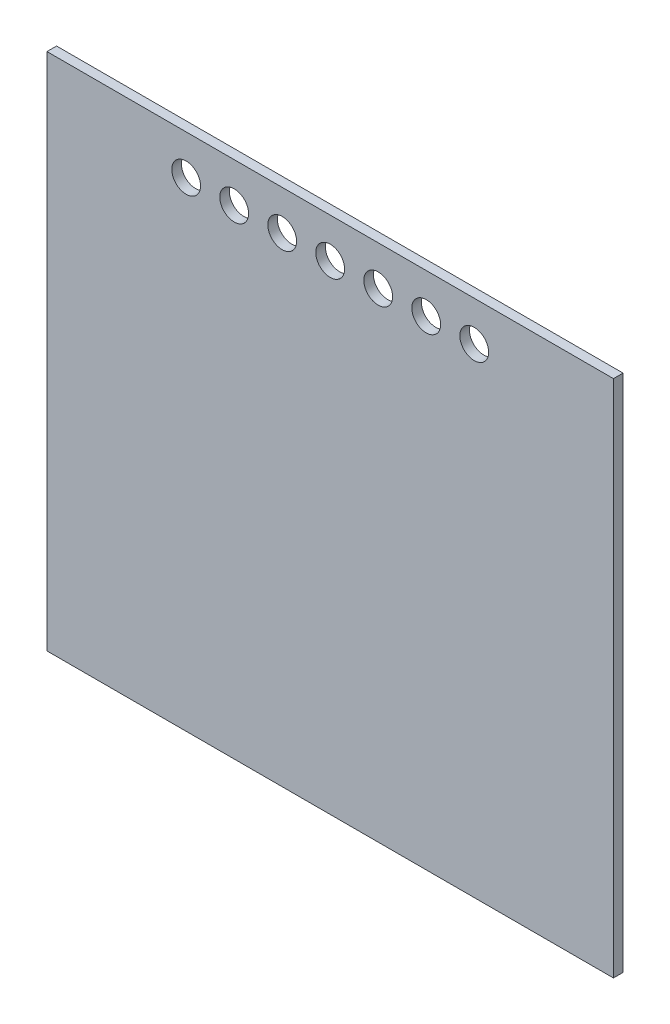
ISO-10303-21;
HEADER;
FILE_DESCRIPTION(('STEP AP214'),'2;1');
FILE_NAME('part.step','',(''),(''),'','','');
FILE_SCHEMA(('AUTOMOTIVE_DESIGN { 1 0 10303 214 1 1 1 1 }'));
ENDSEC;
DATA;
#1=APPLICATION_CONTEXT('core data for automotive mechanical design processes');
#2=APPLICATION_PROTOCOL_DEFINITION('international standard','automotive_design',2000,#1);
#3=PRODUCT_CONTEXT('',#1,'mechanical');
#4=PRODUCT('Part','Part','',(#3));
#5=PRODUCT_RELATED_PRODUCT_CATEGORY('part','',(#4));
#6=PRODUCT_DEFINITION_FORMATION('','',#4);
#7=PRODUCT_DEFINITION_CONTEXT('part definition',#1,'design');
#8=PRODUCT_DEFINITION('design','',#6,#7);
#9=PRODUCT_DEFINITION_SHAPE('','',#8);
#10=(LENGTH_UNIT() NAMED_UNIT(*) SI_UNIT(.MILLI.,.METRE.));
#11=(NAMED_UNIT(*) PLANE_ANGLE_UNIT() SI_UNIT($,.RADIAN.));
#12=(NAMED_UNIT(*) SI_UNIT($,.STERADIAN.) SOLID_ANGLE_UNIT());
#13=UNCERTAINTY_MEASURE_WITH_UNIT(LENGTH_MEASURE(1.E-05),#10,'distance_accuracy_value','');
#14=(GEOMETRIC_REPRESENTATION_CONTEXT(3) GLOBAL_UNCERTAINTY_ASSIGNED_CONTEXT((#13)) GLOBAL_UNIT_ASSIGNED_CONTEXT((#10,
#11,#12)) REPRESENTATION_CONTEXT('',''));
#15=CARTESIAN_POINT('',(0.,0.,0.));
#16=DIRECTION('',(0.,0.,1.));
#17=DIRECTION('',(1.,0.,0.));
#18=AXIS2_PLACEMENT_3D('',#15,#16,#17);
#19=CARTESIAN_POINT('',(374.65,343.2937,-12.7));
#20=DIRECTION('',(1.,0.,0.));
#21=DIRECTION('',(0.,1.,0.));
#22=AXIS2_PLACEMENT_3D('',#19,#20,#21);
#23=PLANE('',#22);
#24=DIRECTION('',(0.,1.,0.));
#25=VECTOR('',#24,1.);
#26=CARTESIAN_POINT('',(374.65,343.2937,0.));
#27=LINE('',#26,#25);
#28=CARTESIAN_POINT('',(374.65,-343.2937,0.));
#29=VERTEX_POINT('',#28);
#30=CARTESIAN_POINT('',(374.65,343.2937,0.));
#31=VERTEX_POINT('',#30);
#32=EDGE_CURVE('E98',#29,#31,#27,.T.);
#33=ORIENTED_EDGE('',*,*,#32,.F.);
#34=DIRECTION('',(0.,0.,1.));
#35=VECTOR('',#34,1.);
#36=CARTESIAN_POINT('',(374.65,-343.2937,-12.7));
#37=LINE('',#36,#35);
#38=CARTESIAN_POINT('',(374.65,-343.2937,-12.7));
#39=VERTEX_POINT('',#38);
#40=EDGE_CURVE('E11',#39,#29,#37,.T.);
#41=ORIENTED_EDGE('',*,*,#40,.F.);
#42=DIRECTION('',(0.,1.,0.));
#43=VECTOR('',#42,1.);
#44=CARTESIAN_POINT('',(374.65,343.2937,-12.7));
#45=LINE('',#44,#43);
#46=CARTESIAN_POINT('',(374.65,343.2937,-12.7));
#47=VERTEX_POINT('',#46);
#48=EDGE_CURVE('E91',#39,#47,#45,.T.);
#49=ORIENTED_EDGE('',*,*,#48,.T.);
#50=DIRECTION('',(0.,0.,1.));
#51=VECTOR('',#50,1.);
#52=CARTESIAN_POINT('',(374.65,343.2937,-12.7));
#53=LINE('',#52,#51);
#54=EDGE_CURVE('E36',#47,#31,#53,.T.);
#55=ORIENTED_EDGE('',*,*,#54,.T.);
#56=EDGE_LOOP('',(#33,#41,#49,#55));
#57=FACE_BOUND('',#56,.T.);
#58=ADVANCED_FACE('F33',(#57),#23,.T.);
#59=CARTESIAN_POINT('',(-374.65,-343.2937,-12.7));
#60=DIRECTION('',(0.,-1.,0.));
#61=DIRECTION('',(0.,0.,-1.));
#62=AXIS2_PLACEMENT_3D('',#59,#60,#61);
#63=PLANE('',#62);
#64=DIRECTION('',(1.,0.,0.));
#65=VECTOR('',#64,1.);
#66=CARTESIAN_POINT('',(-374.65,-343.2937,0.));
#67=LINE('',#66,#65);
#68=CARTESIAN_POINT('',(-374.65,-343.2937,0.));
#69=VERTEX_POINT('',#68);
#70=EDGE_CURVE('E93',#69,#29,#67,.T.);
#71=ORIENTED_EDGE('',*,*,#70,.F.);
#72=DIRECTION('',(0.,0.,1.));
#73=VECTOR('',#72,1.);
#74=CARTESIAN_POINT('',(-374.65,-343.2937,-12.7));
#75=LINE('',#74,#73);
#76=CARTESIAN_POINT('',(-374.65,-343.2937,-12.7));
#77=VERTEX_POINT('',#76);
#78=EDGE_CURVE('E42',#77,#69,#75,.T.);
#79=ORIENTED_EDGE('',*,*,#78,.F.);
#80=DIRECTION('',(1.,0.,0.));
#81=VECTOR('',#80,1.);
#82=CARTESIAN_POINT('',(-374.65,-343.2937,-12.7));
#83=LINE('',#82,#81);
#84=EDGE_CURVE('E88',#77,#39,#83,.T.);
#85=ORIENTED_EDGE('',*,*,#84,.T.);
#86=ORIENTED_EDGE('',*,*,#40,.T.);
#87=EDGE_LOOP('',(#71,#79,#85,#86));
#88=FACE_BOUND('',#87,.T.);
#89=ADVANCED_FACE('F109',(#88),#63,.T.);
#90=CARTESIAN_POINT('',(-374.65,343.2937,-12.7));
#91=DIRECTION('',(-1.,0.,0.));
#92=DIRECTION('',(0.,-1.,0.));
#93=AXIS2_PLACEMENT_3D('',#90,#91,#92);
#94=PLANE('',#93);
#95=DIRECTION('',(0.,-1.,0.));
#96=VECTOR('',#95,1.);
#97=CARTESIAN_POINT('',(-374.65,343.2937,0.));
#98=LINE('',#97,#96);
#99=CARTESIAN_POINT('',(-374.65,343.2937,0.));
#100=VERTEX_POINT('',#99);
#101=EDGE_CURVE('E83',#100,#69,#98,.T.);
#102=ORIENTED_EDGE('',*,*,#101,.F.);
#103=DIRECTION('',(0.,0.,1.));
#104=VECTOR('',#103,1.);
#105=CARTESIAN_POINT('',(-374.65,343.2937,-12.7));
#106=LINE('',#105,#104);
#107=CARTESIAN_POINT('',(-374.65,343.2937,-12.7));
#108=VERTEX_POINT('',#107);
#109=EDGE_CURVE('E78',#108,#100,#106,.T.);
#110=ORIENTED_EDGE('',*,*,#109,.F.);
#111=DIRECTION('',(0.,-1.,0.));
#112=VECTOR('',#111,1.);
#113=CARTESIAN_POINT('',(-374.65,343.2937,-12.7));
#114=LINE('',#113,#112);
#115=EDGE_CURVE('E81',#108,#77,#114,.T.);
#116=ORIENTED_EDGE('',*,*,#115,.T.);
#117=ORIENTED_EDGE('',*,*,#78,.T.);
#118=EDGE_LOOP('',(#102,#110,#116,#117));
#119=FACE_BOUND('',#118,.T.);
#120=ADVANCED_FACE('F80',(#119),#94,.T.);
#121=CARTESIAN_POINT('',(-374.65,343.2937,-12.7));
#122=DIRECTION('',(0.,1.,0.));
#123=DIRECTION('',(0.,0.,1.));
#124=AXIS2_PLACEMENT_3D('',#121,#122,#123);
#125=PLANE('',#124);
#126=DIRECTION('',(-1.,0.,0.));
#127=VECTOR('',#126,1.);
#128=CARTESIAN_POINT('',(-374.65,343.2937,0.));
#129=LINE('',#128,#127);
#130=EDGE_CURVE('E101',#31,#100,#129,.T.);
#131=ORIENTED_EDGE('',*,*,#130,.F.);
#132=ORIENTED_EDGE('',*,*,#54,.F.);
#133=DIRECTION('',(-1.,0.,0.));
#134=VECTOR('',#133,1.);
#135=CARTESIAN_POINT('',(-374.65,343.2937,-12.7));
#136=LINE('',#135,#134);
#137=EDGE_CURVE('E87',#47,#108,#136,.T.);
#138=ORIENTED_EDGE('',*,*,#137,.T.);
#139=ORIENTED_EDGE('',*,*,#109,.T.);
#140=EDGE_LOOP('',(#131,#132,#138,#139));
#141=FACE_BOUND('',#140,.T.);
#142=ADVANCED_FACE('F90',(#141),#125,.T.);
#143=CARTESIAN_POINT('',(0.,0.,-12.7));
#144=DIRECTION('',(0.,0.,1.));
#145=DIRECTION('',(1.,0.,0.));
#146=AXIS2_PLACEMENT_3D('',#143,#144,#145);
#147=PLANE('',#146);
#148=CARTESIAN_POINT('',(127.,290.9062,-12.7));
#149=DIRECTION('',(0.,0.,1.));
#150=DIRECTION('',(1.,0.,0.));
#151=AXIS2_PLACEMENT_3D('',#148,#149,#150);
#152=CIRCLE('',#151,19.05);
#153=CARTESIAN_POINT('',(146.05,290.9062,-12.7));
#154=VERTEX_POINT('',#153);
#155=EDGE_CURVE('E162',#154,#154,#152,.T.);
#156=ORIENTED_EDGE('',*,*,#155,.T.);
#157=EDGE_LOOP('',(#156));
#158=FACE_BOUND('',#157,.T.);
#159=CARTESIAN_POINT('',(63.5,290.9062,-12.7));
#160=DIRECTION('',(0.,0.,1.));
#161=DIRECTION('',(1.,0.,0.));
#162=AXIS2_PLACEMENT_3D('',#159,#160,#161);
#163=CIRCLE('',#162,19.05);
#164=CARTESIAN_POINT('',(82.55,290.9062,-12.7));
#165=VERTEX_POINT('',#164);
#166=EDGE_CURVE('E170',#165,#165,#163,.T.);
#167=ORIENTED_EDGE('',*,*,#166,.T.);
#168=EDGE_LOOP('',(#167));
#169=FACE_BOUND('',#168,.T.);
#170=CARTESIAN_POINT('',(0.,290.9062,-12.7));
#171=DIRECTION('',(0.,0.,1.));
#172=DIRECTION('',(1.,0.,0.));
#173=AXIS2_PLACEMENT_3D('',#170,#171,#172);
#174=CIRCLE('',#173,19.05);
#175=CARTESIAN_POINT('',(19.05,290.9062,-12.7));
#176=VERTEX_POINT('',#175);
#177=EDGE_CURVE('E176',#176,#176,#174,.T.);
#178=ORIENTED_EDGE('',*,*,#177,.T.);
#179=EDGE_LOOP('',(#178));
#180=FACE_BOUND('',#179,.T.);
#181=CARTESIAN_POINT('',(-63.5,290.9062,-12.7));
#182=DIRECTION('',(0.,0.,1.));
#183=DIRECTION('',(1.,0.,0.));
#184=AXIS2_PLACEMENT_3D('',#181,#182,#183);
#185=CIRCLE('',#184,19.05);
#186=CARTESIAN_POINT('',(-44.45,290.9062,-12.7));
#187=VERTEX_POINT('',#186);
#188=EDGE_CURVE('E182',#187,#187,#185,.T.);
#189=ORIENTED_EDGE('',*,*,#188,.T.);
#190=EDGE_LOOP('',(#189));
#191=FACE_BOUND('',#190,.T.);
#192=CARTESIAN_POINT('',(-127.,290.9062,-12.7));
#193=DIRECTION('',(0.,0.,1.));
#194=DIRECTION('',(1.,0.,0.));
#195=AXIS2_PLACEMENT_3D('',#192,#193,#194);
#196=CIRCLE('',#195,19.05);
#197=CARTESIAN_POINT('',(-107.95,290.9062,-12.7));
#198=VERTEX_POINT('',#197);
#199=EDGE_CURVE('E188',#198,#198,#196,.T.);
#200=ORIENTED_EDGE('',*,*,#199,.T.);
#201=EDGE_LOOP('',(#200));
#202=FACE_BOUND('',#201,.T.);
#203=CARTESIAN_POINT('',(190.5,290.9062,-12.7));
#204=DIRECTION('',(0.,0.,1.));
#205=DIRECTION('',(1.,0.,0.));
#206=AXIS2_PLACEMENT_3D('',#203,#204,#205);
#207=CIRCLE('',#206,19.05);
#208=CARTESIAN_POINT('',(209.55,290.9062,-12.7));
#209=VERTEX_POINT('',#208);
#210=EDGE_CURVE('E194',#209,#209,#207,.T.);
#211=ORIENTED_EDGE('',*,*,#210,.T.);
#212=EDGE_LOOP('',(#211));
#213=FACE_BOUND('',#212,.T.);
#214=CARTESIAN_POINT('',(-190.5,290.9062,-12.7));
#215=DIRECTION('',(0.,0.,1.));
#216=DIRECTION('',(1.,0.,0.));
#217=AXIS2_PLACEMENT_3D('',#214,#215,#216);
#218=CIRCLE('',#217,19.05);
#219=CARTESIAN_POINT('',(-171.45,290.9062,-12.7));
#220=VERTEX_POINT('',#219);
#221=EDGE_CURVE('E102',#220,#220,#218,.T.);
#222=ORIENTED_EDGE('',*,*,#221,.T.);
#223=EDGE_LOOP('',(#222));
#224=FACE_BOUND('',#223,.T.);
#225=ORIENTED_EDGE('',*,*,#48,.F.);
#226=ORIENTED_EDGE('',*,*,#84,.F.);
#227=ORIENTED_EDGE('',*,*,#115,.F.);
#228=ORIENTED_EDGE('',*,*,#137,.F.);
#229=EDGE_LOOP('',(#225,#226,#227,#228));
#230=FACE_BOUND('',#229,.T.);
#231=ADVANCED_FACE('F86',(#158,#169,#180,#191,#202,#213,#224,#230),#147,.F.);
#232=CARTESIAN_POINT('',(0.,0.,0.));
#233=DIRECTION('',(0.,0.,1.));
#234=DIRECTION('',(1.,0.,0.));
#235=AXIS2_PLACEMENT_3D('',#232,#233,#234);
#236=PLANE('',#235);
#237=CARTESIAN_POINT('',(127.,290.9062,0.));
#238=DIRECTION('',(0.,0.,1.));
#239=DIRECTION('',(1.,0.,0.));
#240=AXIS2_PLACEMENT_3D('',#237,#238,#239);
#241=CIRCLE('',#240,19.05);
#242=CARTESIAN_POINT('',(146.05,290.9062,0.));
#243=VERTEX_POINT('',#242);
#244=EDGE_CURVE('E165',#243,#243,#241,.T.);
#245=ORIENTED_EDGE('',*,*,#244,.F.);
#246=EDGE_LOOP('',(#245));
#247=FACE_BOUND('',#246,.T.);
#248=CARTESIAN_POINT('',(63.5,290.9062,0.));
#249=DIRECTION('',(0.,0.,1.));
#250=DIRECTION('',(1.,0.,0.));
#251=AXIS2_PLACEMENT_3D('',#248,#249,#250);
#252=CIRCLE('',#251,19.05);
#253=CARTESIAN_POINT('',(82.55,290.9062,0.));
#254=VERTEX_POINT('',#253);
#255=EDGE_CURVE('E167',#254,#254,#252,.T.);
#256=ORIENTED_EDGE('',*,*,#255,.F.);
#257=EDGE_LOOP('',(#256));
#258=FACE_BOUND('',#257,.T.);
#259=CARTESIAN_POINT('',(0.,290.9062,0.));
#260=DIRECTION('',(0.,0.,1.));
#261=DIRECTION('',(1.,0.,0.));
#262=AXIS2_PLACEMENT_3D('',#259,#260,#261);
#263=CIRCLE('',#262,19.05);
#264=CARTESIAN_POINT('',(19.05,290.9062,0.));
#265=VERTEX_POINT('',#264);
#266=EDGE_CURVE('E173',#265,#265,#263,.T.);
#267=ORIENTED_EDGE('',*,*,#266,.F.);
#268=EDGE_LOOP('',(#267));
#269=FACE_BOUND('',#268,.T.);
#270=CARTESIAN_POINT('',(-63.5,290.9062,0.));
#271=DIRECTION('',(0.,0.,1.));
#272=DIRECTION('',(1.,0.,0.));
#273=AXIS2_PLACEMENT_3D('',#270,#271,#272);
#274=CIRCLE('',#273,19.05);
#275=CARTESIAN_POINT('',(-44.45,290.9062,0.));
#276=VERTEX_POINT('',#275);
#277=EDGE_CURVE('E179',#276,#276,#274,.T.);
#278=ORIENTED_EDGE('',*,*,#277,.F.);
#279=EDGE_LOOP('',(#278));
#280=FACE_BOUND('',#279,.T.);
#281=CARTESIAN_POINT('',(-127.,290.9062,0.));
#282=DIRECTION('',(0.,0.,1.));
#283=DIRECTION('',(1.,0.,0.));
#284=AXIS2_PLACEMENT_3D('',#281,#282,#283);
#285=CIRCLE('',#284,19.05);
#286=CARTESIAN_POINT('',(-107.95,290.9062,0.));
#287=VERTEX_POINT('',#286);
#288=EDGE_CURVE('E185',#287,#287,#285,.T.);
#289=ORIENTED_EDGE('',*,*,#288,.F.);
#290=EDGE_LOOP('',(#289));
#291=FACE_BOUND('',#290,.T.);
#292=CARTESIAN_POINT('',(190.5,290.9062,0.));
#293=DIRECTION('',(0.,0.,1.));
#294=DIRECTION('',(1.,0.,0.));
#295=AXIS2_PLACEMENT_3D('',#292,#293,#294);
#296=CIRCLE('',#295,19.05);
#297=CARTESIAN_POINT('',(209.55,290.9062,0.));
#298=VERTEX_POINT('',#297);
#299=EDGE_CURVE('E191',#298,#298,#296,.T.);
#300=ORIENTED_EDGE('',*,*,#299,.F.);
#301=EDGE_LOOP('',(#300));
#302=FACE_BOUND('',#301,.T.);
#303=CARTESIAN_POINT('',(-190.5,290.9062,0.));
#304=DIRECTION('',(0.,0.,1.));
#305=DIRECTION('',(1.,0.,0.));
#306=AXIS2_PLACEMENT_3D('',#303,#304,#305);
#307=CIRCLE('',#306,19.05);
#308=CARTESIAN_POINT('',(-171.45,290.9062,0.));
#309=VERTEX_POINT('',#308);
#310=EDGE_CURVE('E197',#309,#309,#307,.T.);
#311=ORIENTED_EDGE('',*,*,#310,.F.);
#312=EDGE_LOOP('',(#311));
#313=FACE_BOUND('',#312,.T.);
#314=ORIENTED_EDGE('',*,*,#32,.T.);
#315=ORIENTED_EDGE('',*,*,#130,.T.);
#316=ORIENTED_EDGE('',*,*,#101,.T.);
#317=ORIENTED_EDGE('',*,*,#70,.T.);
#318=EDGE_LOOP('',(#314,#315,#316,#317));
#319=FACE_BOUND('',#318,.T.);
#320=ADVANCED_FACE('F108',(#247,#258,#269,#280,#291,#302,#313,#319),#236,.T.);
#321=CARTESIAN_POINT('',(-190.5,290.9062,-12.7));
#322=DIRECTION('',(0.,0.,1.));
#323=DIRECTION('',(1.,0.,0.));
#324=AXIS2_PLACEMENT_3D('',#321,#322,#323);
#325=CYLINDRICAL_SURFACE('',#324,19.05);
#326=ORIENTED_EDGE('',*,*,#221,.F.);
#327=EDGE_LOOP('',(#326));
#328=FACE_BOUND('',#327,.T.);
#329=ORIENTED_EDGE('',*,*,#310,.T.);
#330=EDGE_LOOP('',(#329));
#331=FACE_BOUND('',#330,.T.);
#332=ADVANCED_FACE('F127',(#328,#331),#325,.F.);
#333=CARTESIAN_POINT('',(190.5,290.9062,-12.7));
#334=DIRECTION('',(0.,0.,1.));
#335=DIRECTION('',(1.,0.,0.));
#336=AXIS2_PLACEMENT_3D('',#333,#334,#335);
#337=CYLINDRICAL_SURFACE('',#336,19.05);
#338=ORIENTED_EDGE('',*,*,#210,.F.);
#339=EDGE_LOOP('',(#338));
#340=FACE_BOUND('',#339,.T.);
#341=ORIENTED_EDGE('',*,*,#299,.T.);
#342=EDGE_LOOP('',(#341));
#343=FACE_BOUND('',#342,.T.);
#344=ADVANCED_FACE('F134',(#340,#343),#337,.F.);
#345=CARTESIAN_POINT('',(-127.,290.9062,-12.7));
#346=DIRECTION('',(0.,0.,1.));
#347=DIRECTION('',(1.,0.,0.));
#348=AXIS2_PLACEMENT_3D('',#345,#346,#347);
#349=CYLINDRICAL_SURFACE('',#348,19.05);
#350=ORIENTED_EDGE('',*,*,#199,.F.);
#351=EDGE_LOOP('',(#350));
#352=FACE_BOUND('',#351,.T.);
#353=ORIENTED_EDGE('',*,*,#288,.T.);
#354=EDGE_LOOP('',(#353));
#355=FACE_BOUND('',#354,.T.);
#356=ADVANCED_FACE('F138',(#352,#355),#349,.F.);
#357=CARTESIAN_POINT('',(-63.5,290.9062,-12.7));
#358=DIRECTION('',(0.,0.,1.));
#359=DIRECTION('',(1.,0.,0.));
#360=AXIS2_PLACEMENT_3D('',#357,#358,#359);
#361=CYLINDRICAL_SURFACE('',#360,19.05);
#362=ORIENTED_EDGE('',*,*,#188,.F.);
#363=EDGE_LOOP('',(#362));
#364=FACE_BOUND('',#363,.T.);
#365=ORIENTED_EDGE('',*,*,#277,.T.);
#366=EDGE_LOOP('',(#365));
#367=FACE_BOUND('',#366,.T.);
#368=ADVANCED_FACE('F142',(#364,#367),#361,.F.);
#369=CARTESIAN_POINT('',(0.,290.9062,-12.7));
#370=DIRECTION('',(0.,0.,1.));
#371=DIRECTION('',(1.,0.,0.));
#372=AXIS2_PLACEMENT_3D('',#369,#370,#371);
#373=CYLINDRICAL_SURFACE('',#372,19.05);
#374=ORIENTED_EDGE('',*,*,#177,.F.);
#375=EDGE_LOOP('',(#374));
#376=FACE_BOUND('',#375,.T.);
#377=ORIENTED_EDGE('',*,*,#266,.T.);
#378=EDGE_LOOP('',(#377));
#379=FACE_BOUND('',#378,.T.);
#380=ADVANCED_FACE('F146',(#376,#379),#373,.F.);
#381=CARTESIAN_POINT('',(63.5,290.9062,-12.7));
#382=DIRECTION('',(0.,0.,1.));
#383=DIRECTION('',(1.,0.,0.));
#384=AXIS2_PLACEMENT_3D('',#381,#382,#383);
#385=CYLINDRICAL_SURFACE('',#384,19.05);
#386=ORIENTED_EDGE('',*,*,#166,.F.);
#387=EDGE_LOOP('',(#386));
#388=FACE_BOUND('',#387,.T.);
#389=ORIENTED_EDGE('',*,*,#255,.T.);
#390=EDGE_LOOP('',(#389));
#391=FACE_BOUND('',#390,.T.);
#392=ADVANCED_FACE('F150',(#388,#391),#385,.F.);
#393=CARTESIAN_POINT('',(127.,290.9062,-12.7));
#394=DIRECTION('',(0.,0.,1.));
#395=DIRECTION('',(1.,0.,0.));
#396=AXIS2_PLACEMENT_3D('',#393,#394,#395);
#397=CYLINDRICAL_SURFACE('',#396,19.05);
#398=ORIENTED_EDGE('',*,*,#155,.F.);
#399=EDGE_LOOP('',(#398));
#400=FACE_BOUND('',#399,.T.);
#401=ORIENTED_EDGE('',*,*,#244,.T.);
#402=EDGE_LOOP('',(#401));
#403=FACE_BOUND('',#402,.T.);
#404=ADVANCED_FACE('F154',(#400,#403),#397,.F.);
#405=CLOSED_SHELL('',(#58,#89,#120,#142,#231,#320,#332,#344,#356,#368,#380,#392,#404));
#406=MANIFOLD_SOLID_BREP('B2',#405);
#407=ADVANCED_BREP_SHAPE_REPRESENTATION('',(#18,#406),#14);
#408=SHAPE_DEFINITION_REPRESENTATION(#9,#407);
ENDSEC;
END-ISO-10303-21;
